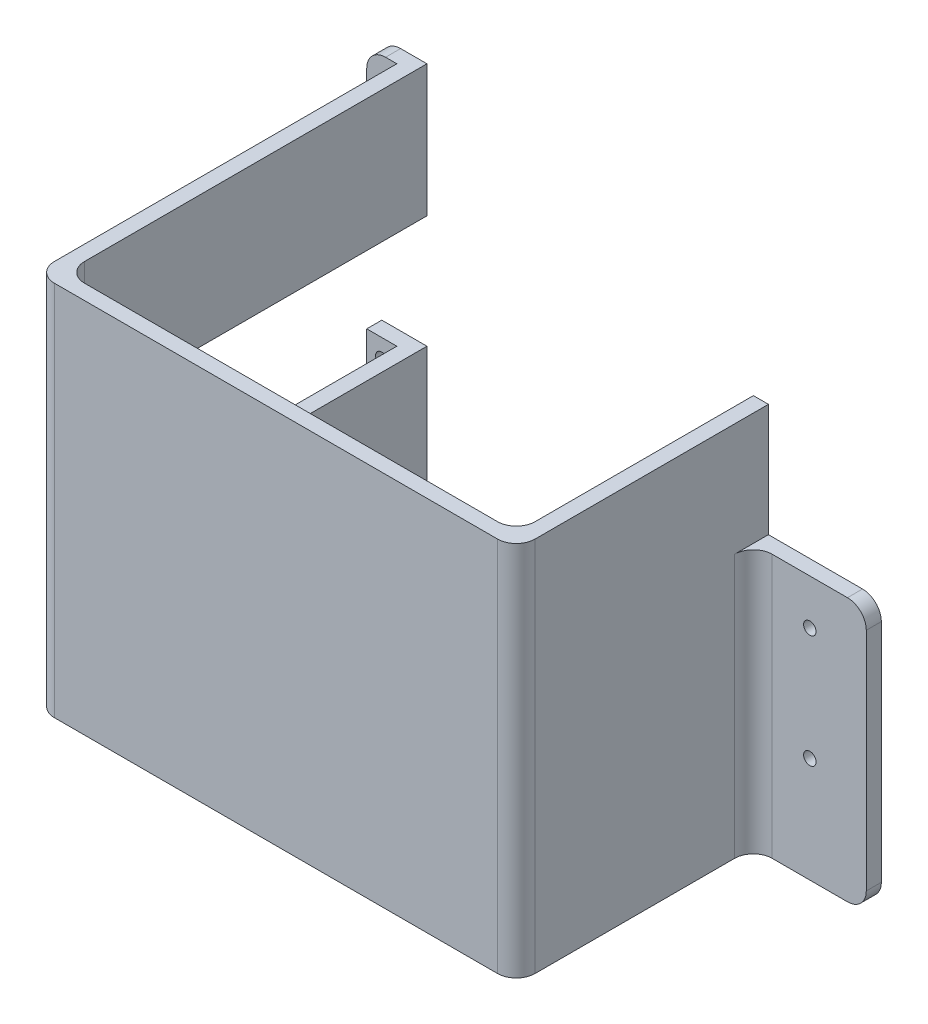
ISO-10303-21;
HEADER;
FILE_DESCRIPTION(('STEP AP214'),'2;1');
FILE_NAME('part.step','',(''),(''),'','','');
FILE_SCHEMA(('AUTOMOTIVE_DESIGN { 1 0 10303 214 1 1 1 1 }'));
ENDSEC;
DATA;
#1=APPLICATION_CONTEXT('core data for automotive mechanical design processes');
#2=APPLICATION_PROTOCOL_DEFINITION('international standard','automotive_design',2000,#1);
#3=PRODUCT_CONTEXT('',#1,'mechanical');
#4=PRODUCT('Part','Part','',(#3));
#5=PRODUCT_RELATED_PRODUCT_CATEGORY('part','',(#4));
#6=PRODUCT_DEFINITION_FORMATION('','',#4);
#7=PRODUCT_DEFINITION_CONTEXT('part definition',#1,'design');
#8=PRODUCT_DEFINITION('design','',#6,#7);
#9=PRODUCT_DEFINITION_SHAPE('','',#8);
#10=(LENGTH_UNIT() NAMED_UNIT(*) SI_UNIT(.MILLI.,.METRE.));
#11=(NAMED_UNIT(*) PLANE_ANGLE_UNIT() SI_UNIT($,.RADIAN.));
#12=(NAMED_UNIT(*) SI_UNIT($,.STERADIAN.) SOLID_ANGLE_UNIT());
#13=UNCERTAINTY_MEASURE_WITH_UNIT(LENGTH_MEASURE(1.E-05),#10,'distance_accuracy_value','');
#14=(GEOMETRIC_REPRESENTATION_CONTEXT(3) GLOBAL_UNCERTAINTY_ASSIGNED_CONTEXT((#13)) GLOBAL_UNIT_ASSIGNED_CONTEXT((#10,
#11,#12)) REPRESENTATION_CONTEXT('',''));
#15=CARTESIAN_POINT('',(0.,0.,0.));
#16=DIRECTION('',(0.,0.,1.));
#17=DIRECTION('',(1.,0.,0.));
#18=AXIS2_PLACEMENT_3D('',#15,#16,#17);
#19=CARTESIAN_POINT('',(13.,0.,95.));
#20=DIRECTION('',(0.,1.,0.));
#21=DIRECTION('',(0.,0.,1.));
#22=AXIS2_PLACEMENT_3D('',#19,#20,#21);
#23=CYLINDRICAL_SURFACE('',#22,5.);
#24=CARTESIAN_POINT('',(13.,0.,95.));
#25=DIRECTION('',(0.,-1.,0.));
#26=DIRECTION('',(0.,0.,-1.));
#27=AXIS2_PLACEMENT_3D('',#24,#25,#26);
#28=CIRCLE('',#27,5.);
#29=CARTESIAN_POINT('',(13.,0.,100.));
#30=VERTEX_POINT('',#29);
#31=CARTESIAN_POINT('',(8.,0.,95.));
#32=VERTEX_POINT('',#31);
#33=EDGE_CURVE('E370',#30,#32,#28,.T.);
#34=ORIENTED_EDGE('',*,*,#33,.F.);
#35=DIRECTION('',(0.,-1.,0.));
#36=VECTOR('',#35,1.);
#37=CARTESIAN_POINT('',(13.,0.,100.));
#38=LINE('',#37,#36);
#39=CARTESIAN_POINT('',(13.,100.,100.));
#40=VERTEX_POINT('',#39);
#41=EDGE_CURVE('E331',#40,#30,#38,.T.);
#42=ORIENTED_EDGE('',*,*,#41,.F.);
#43=CARTESIAN_POINT('',(13.,100.,95.));
#44=DIRECTION('',(0.,1.,0.));
#45=DIRECTION('',(0.,0.,1.));
#46=AXIS2_PLACEMENT_3D('',#43,#44,#45);
#47=CIRCLE('',#46,5.);
#48=CARTESIAN_POINT('',(8.,100.,95.));
#49=VERTEX_POINT('',#48);
#50=EDGE_CURVE('E497',#49,#40,#47,.T.);
#51=ORIENTED_EDGE('',*,*,#50,.F.);
#52=DIRECTION('',(0.,1.,0.));
#53=VECTOR('',#52,1.);
#54=CARTESIAN_POINT('',(8.,0.,95.));
#55=LINE('',#54,#53);
#56=EDGE_CURVE('E315',#32,#49,#55,.T.);
#57=ORIENTED_EDGE('',*,*,#56,.F.);
#58=EDGE_LOOP('',(#34,#42,#51,#57));
#59=FACE_BOUND('',#58,.T.);
#60=ADVANCED_FACE('F17',(#59),#23,.T.);
#61=CARTESIAN_POINT('',(17.,0.,91.));
#62=DIRECTION('',(0.,-1.,0.));
#63=DIRECTION('',(1.,0.,0.));
#64=AXIS2_PLACEMENT_3D('',#61,#62,#63);
#65=CYLINDRICAL_SURFACE('',#64,5.);
#66=CARTESIAN_POINT('',(17.,0.,91.));
#67=DIRECTION('',(0.,1.,0.));
#68=DIRECTION('',(0.,0.,-1.));
#69=AXIS2_PLACEMENT_3D('',#66,#67,#68);
#70=CIRCLE('',#69,5.);
#71=CARTESIAN_POINT('',(12.,0.,91.));
#72=VERTEX_POINT('',#71);
#73=CARTESIAN_POINT('',(17.,0.,96.));
#74=VERTEX_POINT('',#73);
#75=EDGE_CURVE('E384',#72,#74,#70,.T.);
#76=ORIENTED_EDGE('',*,*,#75,.F.);
#77=DIRECTION('',(0.,-1.,0.));
#78=VECTOR('',#77,1.);
#79=CARTESIAN_POINT('',(12.,0.,91.));
#80=LINE('',#79,#78);
#81=CARTESIAN_POINT('',(12.,100.,91.));
#82=VERTEX_POINT('',#81);
#83=EDGE_CURVE('E472',#82,#72,#80,.T.);
#84=ORIENTED_EDGE('',*,*,#83,.F.);
#85=CARTESIAN_POINT('',(17.,100.,91.));
#86=DIRECTION('',(0.,-1.,0.));
#87=DIRECTION('',(0.,0.,1.));
#88=AXIS2_PLACEMENT_3D('',#85,#86,#87);
#89=CIRCLE('',#88,5.);
#90=CARTESIAN_POINT('',(17.,100.,96.));
#91=VERTEX_POINT('',#90);
#92=EDGE_CURVE('E534',#91,#82,#89,.T.);
#93=ORIENTED_EDGE('',*,*,#92,.F.);
#94=DIRECTION('',(0.,1.,0.));
#95=VECTOR('',#94,1.);
#96=CARTESIAN_POINT('',(17.,100.,96.));
#97=LINE('',#96,#95);
#98=EDGE_CURVE('E569',#74,#91,#97,.T.);
#99=ORIENTED_EDGE('',*,*,#98,.F.);
#100=EDGE_LOOP('',(#76,#84,#93,#99));
#101=FACE_BOUND('',#100,.T.);
#102=ADVANCED_FACE('F690',(#101),#65,.F.);
#103=CARTESIAN_POINT('',(12.,65.,71.));
#104=DIRECTION('',(0.,0.,-1.));
#105=DIRECTION('',(0.,-1.,0.));
#106=AXIS2_PLACEMENT_3D('',#103,#104,#105);
#107=PLANE('',#106);
#108=DIRECTION('',(0.,-1.,0.));
#109=VECTOR('',#108,1.);
#110=CARTESIAN_POINT('',(8.,65.,71.));
#111=LINE('',#110,#109);
#112=CARTESIAN_POINT('',(8.,65.,71.));
#113=VERTEX_POINT('',#112);
#114=CARTESIAN_POINT('',(8.,35.,71.));
#115=VERTEX_POINT('',#114);
#116=EDGE_CURVE('E319',#113,#115,#111,.T.);
#117=ORIENTED_EDGE('',*,*,#116,.F.);
#118=DIRECTION('',(-1.,0.,0.));
#119=VECTOR('',#118,1.);
#120=CARTESIAN_POINT('',(12.,65.,71.));
#121=LINE('',#120,#119);
#122=CARTESIAN_POINT('',(12.,65.,71.));
#123=VERTEX_POINT('',#122);
#124=EDGE_CURVE('E628',#123,#113,#121,.T.);
#125=ORIENTED_EDGE('',*,*,#124,.F.);
#126=DIRECTION('',(0.,-1.,0.));
#127=VECTOR('',#126,1.);
#128=CARTESIAN_POINT('',(12.,65.,71.));
#129=LINE('',#128,#127);
#130=CARTESIAN_POINT('',(12.,35.,71.));
#131=VERTEX_POINT('',#130);
#132=EDGE_CURVE('E485',#123,#131,#129,.T.);
#133=ORIENTED_EDGE('',*,*,#132,.T.);
#134=DIRECTION('',(-1.,0.,0.));
#135=VECTOR('',#134,1.);
#136=CARTESIAN_POINT('',(12.,35.,71.));
#137=LINE('',#136,#135);
#138=EDGE_CURVE('E369',#131,#115,#137,.T.);
#139=ORIENTED_EDGE('',*,*,#138,.T.);
#140=EDGE_LOOP('',(#117,#125,#133,#139));
#141=FACE_BOUND('',#140,.T.);
#142=ADVANCED_FACE('F645',(#141),#107,.T.);
#143=CARTESIAN_POINT('',(130.75,0.,95.));
#144=DIRECTION('',(0.,1.,0.));
#145=DIRECTION('',(0.,0.,1.));
#146=AXIS2_PLACEMENT_3D('',#143,#144,#145);
#147=CYLINDRICAL_SURFACE('',#146,5.);
#148=CARTESIAN_POINT('',(130.75,0.,95.));
#149=DIRECTION('',(0.,-1.,0.));
#150=DIRECTION('',(0.,0.,-1.));
#151=AXIS2_PLACEMENT_3D('',#148,#149,#150);
#152=CIRCLE('',#151,5.);
#153=CARTESIAN_POINT('',(135.75,0.,95.));
#154=VERTEX_POINT('',#153);
#155=CARTESIAN_POINT('',(130.75,0.,100.));
#156=VERTEX_POINT('',#155);
#157=EDGE_CURVE('E404',#154,#156,#152,.T.);
#158=ORIENTED_EDGE('',*,*,#157,.F.);
#159=DIRECTION('',(0.,-1.,0.));
#160=VECTOR('',#159,1.);
#161=CARTESIAN_POINT('',(135.75,0.,95.));
#162=LINE('',#161,#160);
#163=CARTESIAN_POINT('',(135.75,100.,95.));
#164=VERTEX_POINT('',#163);
#165=EDGE_CURVE('E374',#164,#154,#162,.T.);
#166=ORIENTED_EDGE('',*,*,#165,.F.);
#167=CARTESIAN_POINT('',(130.75,100.,95.));
#168=DIRECTION('',(0.,1.,0.));
#169=DIRECTION('',(0.,0.,1.));
#170=AXIS2_PLACEMENT_3D('',#167,#168,#169);
#171=CIRCLE('',#170,5.);
#172=CARTESIAN_POINT('',(130.75,100.,100.));
#173=VERTEX_POINT('',#172);
#174=EDGE_CURVE('E505',#173,#164,#171,.T.);
#175=ORIENTED_EDGE('',*,*,#174,.F.);
#176=DIRECTION('',(0.,1.,0.));
#177=VECTOR('',#176,1.);
#178=CARTESIAN_POINT('',(130.75,0.,100.));
#179=LINE('',#178,#177);
#180=EDGE_CURVE('E344',#156,#173,#179,.T.);
#181=ORIENTED_EDGE('',*,*,#180,.F.);
#182=EDGE_LOOP('',(#158,#166,#175,#181));
#183=FACE_BOUND('',#182,.T.);
#184=ADVANCED_FACE('F668',(#183),#147,.T.);
#185=CARTESIAN_POINT('',(126.75,100.,91.));
#186=DIRECTION('',(0.,-1.,0.));
#187=DIRECTION('',(1.,0.,0.));
#188=AXIS2_PLACEMENT_3D('',#185,#186,#187);
#189=CYLINDRICAL_SURFACE('',#188,5.);
#190=CARTESIAN_POINT('',(126.75,0.,91.));
#191=DIRECTION('',(0.,1.,0.));
#192=DIRECTION('',(0.,0.,-1.));
#193=AXIS2_PLACEMENT_3D('',#190,#191,#192);
#194=CIRCLE('',#193,5.);
#195=CARTESIAN_POINT('',(126.75,0.,96.));
#196=VERTEX_POINT('',#195);
#197=CARTESIAN_POINT('',(131.75,0.,91.));
#198=VERTEX_POINT('',#197);
#199=EDGE_CURVE('E392',#196,#198,#194,.T.);
#200=ORIENTED_EDGE('',*,*,#199,.F.);
#201=DIRECTION('',(0.,-1.,0.));
#202=VECTOR('',#201,1.);
#203=CARTESIAN_POINT('',(126.75,0.,96.));
#204=LINE('',#203,#202);
#205=CARTESIAN_POINT('',(126.75,100.,96.));
#206=VERTEX_POINT('',#205);
#207=EDGE_CURVE('E580',#206,#196,#204,.T.);
#208=ORIENTED_EDGE('',*,*,#207,.F.);
#209=CARTESIAN_POINT('',(126.75,100.,91.));
#210=DIRECTION('',(0.,-1.,0.));
#211=DIRECTION('',(0.,0.,1.));
#212=AXIS2_PLACEMENT_3D('',#209,#210,#211);
#213=CIRCLE('',#212,5.);
#214=CARTESIAN_POINT('',(131.75,100.,91.));
#215=VERTEX_POINT('',#214);
#216=EDGE_CURVE('E526',#215,#206,#213,.T.);
#217=ORIENTED_EDGE('',*,*,#216,.F.);
#218=DIRECTION('',(0.,1.,0.));
#219=VECTOR('',#218,1.);
#220=CARTESIAN_POINT('',(131.75,100.,91.));
#221=LINE('',#220,#219);
#222=EDGE_CURVE('E332',#198,#215,#221,.T.);
#223=ORIENTED_EDGE('',*,*,#222,.F.);
#224=EDGE_LOOP('',(#200,#208,#217,#223));
#225=FACE_BOUND('',#224,.T.);
#226=ADVANCED_FACE('F681',(#225),#189,.F.);
#227=CARTESIAN_POINT('',(140.75,100.,42.));
#228=DIRECTION('',(0.,-1.,0.));
#229=DIRECTION('',(0.,0.,-1.));
#230=AXIS2_PLACEMENT_3D('',#227,#228,#229);
#231=CYLINDRICAL_SURFACE('',#230,5.);
#232=CARTESIAN_POINT('',(140.75,70.,42.));
#233=DIRECTION('',(0.,-1.,0.));
#234=DIRECTION('',(0.,0.,-1.));
#235=AXIS2_PLACEMENT_3D('',#232,#233,#234);
#236=CIRCLE('',#235,5.);
#237=CARTESIAN_POINT('',(135.75,70.,42.));
#238=VERTEX_POINT('',#237);
#239=CARTESIAN_POINT('',(140.75,70.,37.));
#240=VERTEX_POINT('',#239);
#241=EDGE_CURVE('E11',#238,#240,#236,.T.);
#242=ORIENTED_EDGE('',*,*,#241,.F.);
#243=DIRECTION('',(0.,1.,0.));
#244=VECTOR('',#243,1.);
#245=CARTESIAN_POINT('',(135.75,0.,42.));
#246=LINE('',#245,#244);
#247=CARTESIAN_POINT('',(135.75,0.,42.));
#248=VERTEX_POINT('',#247);
#249=EDGE_CURVE('E357',#248,#238,#246,.T.);
#250=ORIENTED_EDGE('',*,*,#249,.F.);
#251=CARTESIAN_POINT('',(140.75,0.,42.));
#252=DIRECTION('',(0.,1.,0.));
#253=DIRECTION('',(0.,0.,-1.));
#254=AXIS2_PLACEMENT_3D('',#251,#252,#253);
#255=CIRCLE('',#254,5.);
#256=CARTESIAN_POINT('',(140.75,0.,37.));
#257=VERTEX_POINT('',#256);
#258=EDGE_CURVE('E403',#257,#248,#255,.T.);
#259=ORIENTED_EDGE('',*,*,#258,.F.);
#260=DIRECTION('',(0.,-1.,0.));
#261=VECTOR('',#260,1.);
#262=CARTESIAN_POINT('',(140.75,100.,37.));
#263=LINE('',#262,#261);
#264=EDGE_CURVE('E398',#240,#257,#263,.T.);
#265=ORIENTED_EDGE('',*,*,#264,.F.);
#266=EDGE_LOOP('',(#242,#250,#259,#265));
#267=FACE_BOUND('',#266,.T.);
#268=ADVANCED_FACE('F745',(#267),#231,.F.);
#269=CARTESIAN_POINT('',(160.75,5.,0.));
#270=DIRECTION('',(0.,0.,1.));
#271=DIRECTION('',(1.,0.,0.));
#272=AXIS2_PLACEMENT_3D('',#269,#270,#271);
#273=CYLINDRICAL_SURFACE('',#272,5.);
#274=CARTESIAN_POINT('',(160.75,5.,37.));
#275=DIRECTION('',(0.,0.,1.));
#276=DIRECTION('',(0.,1.,0.));
#277=AXIS2_PLACEMENT_3D('',#274,#275,#276);
#278=CIRCLE('',#277,5.);
#279=CARTESIAN_POINT('',(160.75,0.,37.));
#280=VERTEX_POINT('',#279);
#281=CARTESIAN_POINT('',(165.75,5.,37.));
#282=VERTEX_POINT('',#281);
#283=EDGE_CURVE('E273',#280,#282,#278,.T.);
#284=ORIENTED_EDGE('',*,*,#283,.F.);
#285=DIRECTION('',(0.,0.,1.));
#286=VECTOR('',#285,1.);
#287=CARTESIAN_POINT('',(160.75,0.,37.));
#288=LINE('',#287,#286);
#289=CARTESIAN_POINT('',(160.75,0.,33.));
#290=VERTEX_POINT('',#289);
#291=EDGE_CURVE('E352',#290,#280,#288,.T.);
#292=ORIENTED_EDGE('',*,*,#291,.F.);
#293=CARTESIAN_POINT('',(160.75,5.,33.));
#294=DIRECTION('',(0.,0.,-1.));
#295=DIRECTION('',(-1.,0.,0.));
#296=AXIS2_PLACEMENT_3D('',#293,#294,#295);
#297=CIRCLE('',#296,5.);
#298=CARTESIAN_POINT('',(165.75,5.,33.));
#299=VERTEX_POINT('',#298);
#300=EDGE_CURVE('E287',#299,#290,#297,.T.);
#301=ORIENTED_EDGE('',*,*,#300,.F.);
#302=DIRECTION('',(0.,0.,-1.));
#303=VECTOR('',#302,1.);
#304=CARTESIAN_POINT('',(165.75,5.,33.));
#305=LINE('',#304,#303);
#306=EDGE_CURVE('E272',#282,#299,#305,.T.);
#307=ORIENTED_EDGE('',*,*,#306,.F.);
#308=EDGE_LOOP('',(#284,#292,#301,#307));
#309=FACE_BOUND('',#308,.T.);
#310=ADVANCED_FACE('F756',(#309),#273,.T.);
#311=CARTESIAN_POINT('',(160.75,65.,0.));
#312=DIRECTION('',(0.,0.,1.));
#313=DIRECTION('',(1.,0.,0.));
#314=AXIS2_PLACEMENT_3D('',#311,#312,#313);
#315=CYLINDRICAL_SURFACE('',#314,5.);
#316=CARTESIAN_POINT('',(160.75,65.,33.));
#317=DIRECTION('',(0.,0.,-1.));
#318=DIRECTION('',(-1.,0.,0.));
#319=AXIS2_PLACEMENT_3D('',#316,#317,#318);
#320=CIRCLE('',#319,5.);
#321=CARTESIAN_POINT('',(160.75,70.,33.));
#322=VERTEX_POINT('',#321);
#323=CARTESIAN_POINT('',(165.75,65.,33.));
#324=VERTEX_POINT('',#323);
#325=EDGE_CURVE('E428',#322,#324,#320,.T.);
#326=ORIENTED_EDGE('',*,*,#325,.F.);
#327=DIRECTION('',(0.,0.,-1.));
#328=VECTOR('',#327,1.);
#329=CARTESIAN_POINT('',(160.75,70.,0.));
#330=LINE('',#329,#328);
#331=CARTESIAN_POINT('',(160.75,70.,37.));
#332=VERTEX_POINT('',#331);
#333=EDGE_CURVE('E20',#332,#322,#330,.T.);
#334=ORIENTED_EDGE('',*,*,#333,.F.);
#335=CARTESIAN_POINT('',(160.75,65.,37.));
#336=DIRECTION('',(0.,0.,1.));
#337=DIRECTION('',(0.,1.,0.));
#338=AXIS2_PLACEMENT_3D('',#335,#336,#337);
#339=CIRCLE('',#338,5.);
#340=CARTESIAN_POINT('',(165.75,65.,37.));
#341=VERTEX_POINT('',#340);
#342=EDGE_CURVE('E276',#341,#332,#339,.T.);
#343=ORIENTED_EDGE('',*,*,#342,.F.);
#344=DIRECTION('',(0.,0.,1.));
#345=VECTOR('',#344,1.);
#346=CARTESIAN_POINT('',(165.75,65.,0.));
#347=LINE('',#346,#345);
#348=EDGE_CURVE('E264',#324,#341,#347,.T.);
#349=ORIENTED_EDGE('',*,*,#348,.F.);
#350=EDGE_LOOP('',(#326,#334,#343,#349));
#351=FACE_BOUND('',#350,.T.);
#352=ADVANCED_FACE('F277',(#351),#315,.T.);
#353=CARTESIAN_POINT('',(5.,95.,4.));
#354=DIRECTION('',(0.,0.,-1.));
#355=DIRECTION('',(-1.,0.,0.));
#356=AXIS2_PLACEMENT_3D('',#353,#354,#355);
#357=CYLINDRICAL_SURFACE('',#356,5.);
#358=CARTESIAN_POINT('',(5.,95.,4.));
#359=DIRECTION('',(0.,0.,1.));
#360=DIRECTION('',(1.,0.,0.));
#361=AXIS2_PLACEMENT_3D('',#358,#359,#360);
#362=CIRCLE('',#361,5.);
#363=CARTESIAN_POINT('',(5.,100.,4.));
#364=VERTEX_POINT('',#363);
#365=CARTESIAN_POINT('',(0.,95.,4.));
#366=VERTEX_POINT('',#365);
#367=EDGE_CURVE('E307',#364,#366,#362,.T.);
#368=ORIENTED_EDGE('',*,*,#367,.F.);
#369=DIRECTION('',(0.,0.,1.));
#370=VECTOR('',#369,1.);
#371=CARTESIAN_POINT('',(5.,100.,4.));
#372=LINE('',#371,#370);
#373=CARTESIAN_POINT('',(5.,100.,0.));
#374=VERTEX_POINT('',#373);
#375=EDGE_CURVE('E537',#374,#364,#372,.T.);
#376=ORIENTED_EDGE('',*,*,#375,.F.);
#377=CARTESIAN_POINT('',(5.,95.,0.));
#378=DIRECTION('',(0.,0.,-1.));
#379=DIRECTION('',(1.,0.,0.));
#380=AXIS2_PLACEMENT_3D('',#377,#378,#379);
#381=CIRCLE('',#380,5.);
#382=CARTESIAN_POINT('',(0.,95.,0.));
#383=VERTEX_POINT('',#382);
#384=EDGE_CURVE('E316',#383,#374,#381,.T.);
#385=ORIENTED_EDGE('',*,*,#384,.F.);
#386=DIRECTION('',(0.,0.,-1.));
#387=VECTOR('',#386,1.);
#388=CARTESIAN_POINT('',(0.,95.,4.));
#389=LINE('',#388,#387);
#390=EDGE_CURVE('E302',#366,#383,#389,.T.);
#391=ORIENTED_EDGE('',*,*,#390,.F.);
#392=EDGE_LOOP('',(#368,#376,#385,#391));
#393=FACE_BOUND('',#392,.T.);
#394=ADVANCED_FACE('F700',(#393),#357,.T.);
#395=CARTESIAN_POINT('',(5.,5.,96.));
#396=DIRECTION('',(0.,0.,-1.));
#397=DIRECTION('',(-1.,0.,0.));
#398=AXIS2_PLACEMENT_3D('',#395,#396,#397);
#399=CYLINDRICAL_SURFACE('',#398,5.);
#400=CARTESIAN_POINT('',(5.,5.,4.));
#401=DIRECTION('',(0.,0.,1.));
#402=DIRECTION('',(1.,0.,0.));
#403=AXIS2_PLACEMENT_3D('',#400,#401,#402);
#404=CIRCLE('',#403,5.);
#405=CARTESIAN_POINT('',(0.,5.,4.));
#406=VERTEX_POINT('',#405);
#407=CARTESIAN_POINT('',(5.,0.,4.));
#408=VERTEX_POINT('',#407);
#409=EDGE_CURVE('E407',#406,#408,#404,.T.);
#410=ORIENTED_EDGE('',*,*,#409,.F.);
#411=DIRECTION('',(0.,0.,1.));
#412=VECTOR('',#411,1.);
#413=CARTESIAN_POINT('',(0.,5.,4.));
#414=LINE('',#413,#412);
#415=CARTESIAN_POINT('',(0.,5.,0.));
#416=VERTEX_POINT('',#415);
#417=EDGE_CURVE('E388',#416,#406,#414,.T.);
#418=ORIENTED_EDGE('',*,*,#417,.F.);
#419=CARTESIAN_POINT('',(5.,5.,0.));
#420=DIRECTION('',(0.,0.,-1.));
#421=DIRECTION('',(1.,0.,0.));
#422=AXIS2_PLACEMENT_3D('',#419,#420,#421);
#423=CIRCLE('',#422,5.);
#424=CARTESIAN_POINT('',(5.,0.,0.));
#425=VERTEX_POINT('',#424);
#426=EDGE_CURVE('E336',#425,#416,#423,.T.);
#427=ORIENTED_EDGE('',*,*,#426,.F.);
#428=DIRECTION('',(0.,0.,-1.));
#429=VECTOR('',#428,1.);
#430=CARTESIAN_POINT('',(5.,0.,96.));
#431=LINE('',#430,#429);
#432=EDGE_CURVE('E377',#408,#425,#431,.T.);
#433=ORIENTED_EDGE('',*,*,#432,.F.);
#434=EDGE_LOOP('',(#410,#418,#427,#433));
#435=FACE_BOUND('',#434,.T.);
#436=ADVANCED_FACE('F715',(#435),#399,.T.);
#437=CARTESIAN_POINT('',(165.75,70.,0.));
#438=DIRECTION('',(0.,-1.,0.));
#439=DIRECTION('',(0.,0.,-1.));
#440=AXIS2_PLACEMENT_3D('',#437,#438,#439);
#441=PLANE('',#440);
#442=DIRECTION('',(1.,0.,0.));
#443=VECTOR('',#442,1.);
#444=CARTESIAN_POINT('',(165.75,70.,37.));
#445=LINE('',#444,#443);
#446=EDGE_CURVE('E281',#240,#332,#445,.T.);
#447=ORIENTED_EDGE('',*,*,#446,.T.);
#448=ORIENTED_EDGE('',*,*,#333,.T.);
#449=DIRECTION('',(-1.,0.,0.));
#450=VECTOR('',#449,1.);
#451=CARTESIAN_POINT('',(0.,70.,33.));
#452=LINE('',#451,#450);
#453=CARTESIAN_POINT('',(135.75,70.,33.));
#454=VERTEX_POINT('',#453);
#455=EDGE_CURVE('E427',#322,#454,#452,.T.);
#456=ORIENTED_EDGE('',*,*,#455,.T.);
#457=DIRECTION('',(0.,0.,1.));
#458=VECTOR('',#457,1.);
#459=CARTESIAN_POINT('',(135.75,70.,0.));
#460=LINE('',#459,#458);
#461=EDGE_CURVE('E361',#454,#238,#460,.T.);
#462=ORIENTED_EDGE('',*,*,#461,.T.);
#463=ORIENTED_EDGE('',*,*,#241,.T.);
#464=EDGE_LOOP('',(#447,#448,#456,#462,#463));
#465=FACE_BOUND('',#464,.T.);
#466=ADVANCED_FACE('F441',(#465),#441,.F.);
#467=CARTESIAN_POINT('',(165.75,0.,0.));
#468=DIRECTION('',(-1.,0.,0.));
#469=DIRECTION('',(0.,0.,1.));
#470=AXIS2_PLACEMENT_3D('',#467,#468,#469);
#471=PLANE('',#470);
#472=DIRECTION('',(0.,1.,0.));
#473=VECTOR('',#472,1.);
#474=CARTESIAN_POINT('',(165.75,100.,33.));
#475=LINE('',#474,#473);
#476=EDGE_CURVE('E269',#299,#324,#475,.T.);
#477=ORIENTED_EDGE('',*,*,#476,.T.);
#478=ORIENTED_EDGE('',*,*,#348,.T.);
#479=DIRECTION('',(0.,-1.,0.));
#480=VECTOR('',#479,1.);
#481=CARTESIAN_POINT('',(165.75,100.,37.));
#482=LINE('',#481,#480);
#483=EDGE_CURVE('E267',#341,#282,#482,.T.);
#484=ORIENTED_EDGE('',*,*,#483,.T.);
#485=ORIENTED_EDGE('',*,*,#306,.T.);
#486=EDGE_LOOP('',(#477,#478,#484,#485));
#487=FACE_BOUND('',#486,.T.);
#488=ADVANCED_FACE('F265',(#487),#471,.F.);
#489=CARTESIAN_POINT('',(165.75,100.,37.));
#490=DIRECTION('',(0.,0.,-1.));
#491=DIRECTION('',(-1.,0.,0.));
#492=AXIS2_PLACEMENT_3D('',#489,#490,#491);
#493=PLANE('',#492);
#494=CARTESIAN_POINT('',(150.749999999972,27.9999999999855,37.));
#495=DIRECTION('',(0.,0.,1.));
#496=DIRECTION('',(1.,0.,0.));
#497=AXIS2_PLACEMENT_3D('',#494,#495,#496);
#498=CIRCLE('',#497,1.65000000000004);
#499=CARTESIAN_POINT('',(152.399999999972,27.9999999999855,37.));
#500=VERTEX_POINT('',#499);
#501=EDGE_CURVE('E589',#500,#500,#498,.T.);
#502=ORIENTED_EDGE('',*,*,#501,.F.);
#503=EDGE_LOOP('',(#502));
#504=FACE_BOUND('',#503,.T.);
#505=CARTESIAN_POINT('',(150.749999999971,57.9999999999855,37.));
#506=DIRECTION('',(0.,0.,1.));
#507=DIRECTION('',(1.,0.,0.));
#508=AXIS2_PLACEMENT_3D('',#505,#506,#507);
#509=CIRCLE('',#508,1.65000000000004);
#510=CARTESIAN_POINT('',(152.399999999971,57.9999999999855,37.));
#511=VERTEX_POINT('',#510);
#512=EDGE_CURVE('E575',#511,#511,#509,.T.);
#513=ORIENTED_EDGE('',*,*,#512,.F.);
#514=EDGE_LOOP('',(#513));
#515=FACE_BOUND('',#514,.T.);
#516=ORIENTED_EDGE('',*,*,#483,.F.);
#517=ORIENTED_EDGE('',*,*,#342,.T.);
#518=ORIENTED_EDGE('',*,*,#446,.F.);
#519=ORIENTED_EDGE('',*,*,#264,.T.);
#520=DIRECTION('',(-1.,0.,0.));
#521=VECTOR('',#520,1.);
#522=CARTESIAN_POINT('',(165.75,0.,37.));
#523=LINE('',#522,#521);
#524=EDGE_CURVE('E399',#280,#257,#523,.T.);
#525=ORIENTED_EDGE('',*,*,#524,.F.);
#526=ORIENTED_EDGE('',*,*,#283,.T.);
#527=EDGE_LOOP('',(#516,#517,#518,#519,#525,#526));
#528=FACE_BOUND('',#527,.T.);
#529=ADVANCED_FACE('F284',(#504,#515,#528),#493,.F.);
#530=CARTESIAN_POINT('',(0.,0.,33.));
#531=DIRECTION('',(0.,0.,-1.));
#532=DIRECTION('',(0.,-1.,0.));
#533=AXIS2_PLACEMENT_3D('',#530,#531,#532);
#534=PLANE('',#533);
#535=CARTESIAN_POINT('',(150.749999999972,27.9999999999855,33.));
#536=DIRECTION('',(0.,0.,-1.));
#537=DIRECTION('',(-1.,0.,0.));
#538=AXIS2_PLACEMENT_3D('',#535,#536,#537);
#539=CIRCLE('',#538,1.65000000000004);
#540=CARTESIAN_POINT('',(149.099999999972,27.9999999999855,33.));
#541=VERTEX_POINT('',#540);
#542=EDGE_CURVE('E579',#541,#541,#539,.T.);
#543=ORIENTED_EDGE('',*,*,#542,.F.);
#544=EDGE_LOOP('',(#543));
#545=FACE_BOUND('',#544,.T.);
#546=CARTESIAN_POINT('',(150.749999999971,57.9999999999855,33.));
#547=DIRECTION('',(0.,0.,-1.));
#548=DIRECTION('',(-1.,0.,0.));
#549=AXIS2_PLACEMENT_3D('',#546,#547,#548);
#550=CIRCLE('',#549,1.65000000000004);
#551=CARTESIAN_POINT('',(149.099999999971,57.9999999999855,33.));
#552=VERTEX_POINT('',#551);
#553=EDGE_CURVE('E571',#552,#552,#550,.T.);
#554=ORIENTED_EDGE('',*,*,#553,.F.);
#555=EDGE_LOOP('',(#554));
#556=FACE_BOUND('',#555,.T.);
#557=ORIENTED_EDGE('',*,*,#455,.F.);
#558=ORIENTED_EDGE('',*,*,#325,.T.);
#559=ORIENTED_EDGE('',*,*,#476,.F.);
#560=ORIENTED_EDGE('',*,*,#300,.T.);
#561=DIRECTION('',(-1.,0.,0.));
#562=VECTOR('',#561,1.);
#563=CARTESIAN_POINT('',(135.75,0.,33.));
#564=LINE('',#563,#562);
#565=CARTESIAN_POINT('',(131.75,0.,33.));
#566=VERTEX_POINT('',#565);
#567=EDGE_CURVE('E348',#290,#566,#564,.T.);
#568=ORIENTED_EDGE('',*,*,#567,.T.);
#569=DIRECTION('',(0.,1.,0.));
#570=VECTOR('',#569,1.);
#571=CARTESIAN_POINT('',(131.75,100.,33.));
#572=LINE('',#571,#570);
#573=CARTESIAN_POINT('',(131.75,100.,33.));
#574=VERTEX_POINT('',#573);
#575=EDGE_CURVE('E335',#566,#574,#572,.T.);
#576=ORIENTED_EDGE('',*,*,#575,.T.);
#577=DIRECTION('',(1.,0.,0.));
#578=VECTOR('',#577,1.);
#579=CARTESIAN_POINT('',(135.75,100.,33.));
#580=LINE('',#579,#578);
#581=CARTESIAN_POINT('',(135.75,100.,33.));
#582=VERTEX_POINT('',#581);
#583=EDGE_CURVE('E515',#574,#582,#580,.T.);
#584=ORIENTED_EDGE('',*,*,#583,.T.);
#585=DIRECTION('',(0.,1.,0.));
#586=VECTOR('',#585,1.);
#587=CARTESIAN_POINT('',(135.75,0.,33.));
#588=LINE('',#587,#586);
#589=EDGE_CURVE('E364',#454,#582,#588,.T.);
#590=ORIENTED_EDGE('',*,*,#589,.F.);
#591=EDGE_LOOP('',(#557,#558,#559,#560,#568,#576,#584,#590));
#592=FACE_BOUND('',#591,.T.);
#593=ADVANCED_FACE('F445',(#545,#556,#592),#534,.T.);
#594=CARTESIAN_POINT('',(131.75,100.,-67.0799680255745));
#595=DIRECTION('',(1.,0.,0.));
#596=DIRECTION('',(0.,-1.,0.));
#597=AXIS2_PLACEMENT_3D('',#594,#595,#596);
#598=PLANE('',#597);
#599=DIRECTION('',(0.,0.,1.));
#600=VECTOR('',#599,1.);
#601=CARTESIAN_POINT('',(131.75,0.,-67.0799680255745));
#602=LINE('',#601,#600);
#603=EDGE_CURVE('E353',#566,#198,#602,.T.);
#604=ORIENTED_EDGE('',*,*,#603,.T.);
#605=ORIENTED_EDGE('',*,*,#222,.T.);
#606=DIRECTION('',(0.,0.,1.));
#607=VECTOR('',#606,1.);
#608=CARTESIAN_POINT('',(131.75,100.,-67.0799680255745));
#609=LINE('',#608,#607);
#610=EDGE_CURVE('E522',#574,#215,#609,.T.);
#611=ORIENTED_EDGE('',*,*,#610,.F.);
#612=ORIENTED_EDGE('',*,*,#575,.F.);
#613=EDGE_LOOP('',(#604,#605,#611,#612));
#614=FACE_BOUND('',#613,.T.);
#615=ADVANCED_FACE('F677',(#614),#598,.F.);
#616=CARTESIAN_POINT('',(0.,0.,0.));
#617=DIRECTION('',(0.,0.,1.));
#618=DIRECTION('',(1.,0.,0.));
#619=AXIS2_PLACEMENT_3D('',#616,#617,#618);
#620=PLANE('',#619);
#621=CARTESIAN_POINT('',(4.,30.,0.));
#622=DIRECTION('',(0.,0.,1.));
#623=DIRECTION('',(1.,0.,0.));
#624=AXIS2_PLACEMENT_3D('',#621,#622,#623);
#625=CIRCLE('',#624,1.65);
#626=CARTESIAN_POINT('',(5.65,30.,0.));
#627=VERTEX_POINT('',#626);
#628=EDGE_CURVE('E609',#627,#627,#625,.T.);
#629=ORIENTED_EDGE('',*,*,#628,.T.);
#630=EDGE_LOOP('',(#629));
#631=FACE_BOUND('',#630,.T.);
#632=DIRECTION('',(1.,0.,0.));
#633=VECTOR('',#632,1.);
#634=CARTESIAN_POINT('',(0.,0.,0.));
#635=LINE('',#634,#633);
#636=CARTESIAN_POINT('',(12.,0.,0.));
#637=VERTEX_POINT('',#636);
#638=EDGE_CURVE('E381',#425,#637,#635,.T.);
#639=ORIENTED_EDGE('',*,*,#638,.F.);
#640=ORIENTED_EDGE('',*,*,#426,.T.);
#641=DIRECTION('',(0.,1.,0.));
#642=VECTOR('',#641,1.);
#643=CARTESIAN_POINT('',(0.,0.,0.));
#644=LINE('',#643,#642);
#645=CARTESIAN_POINT('',(0.,35.,0.));
#646=VERTEX_POINT('',#645);
#647=EDGE_CURVE('E385',#416,#646,#644,.T.);
#648=ORIENTED_EDGE('',*,*,#647,.T.);
#649=DIRECTION('',(1.,0.,0.));
#650=VECTOR('',#649,1.);
#651=CARTESIAN_POINT('',(0.,35.,0.));
#652=LINE('',#651,#650);
#653=CARTESIAN_POINT('',(12.,35.,0.));
#654=VERTEX_POINT('',#653);
#655=EDGE_CURVE('E365',#646,#654,#652,.T.);
#656=ORIENTED_EDGE('',*,*,#655,.T.);
#657=DIRECTION('',(0.,-1.,0.));
#658=VECTOR('',#657,1.);
#659=CARTESIAN_POINT('',(12.,35.,0.));
#660=LINE('',#659,#658);
#661=EDGE_CURVE('E480',#654,#637,#660,.T.);
#662=ORIENTED_EDGE('',*,*,#661,.T.);
#663=EDGE_LOOP('',(#639,#640,#648,#656,#662));
#664=FACE_BOUND('',#663,.T.);
#665=ADVANCED_FACE('F708',(#631,#664),#620,.F.);
#666=CARTESIAN_POINT('',(0.,0.,4.));
#667=DIRECTION('',(0.,0.,1.));
#668=DIRECTION('',(1.,0.,0.));
#669=AXIS2_PLACEMENT_3D('',#666,#667,#668);
#670=PLANE('',#669);
#671=CARTESIAN_POINT('',(4.,30.,4.));
#672=DIRECTION('',(0.,0.,1.));
#673=DIRECTION('',(1.,0.,0.));
#674=AXIS2_PLACEMENT_3D('',#671,#672,#673);
#675=CIRCLE('',#674,1.65);
#676=CARTESIAN_POINT('',(5.65,30.,4.));
#677=VERTEX_POINT('',#676);
#678=EDGE_CURVE('E597',#677,#677,#675,.T.);
#679=ORIENTED_EDGE('',*,*,#678,.F.);
#680=EDGE_LOOP('',(#679));
#681=FACE_BOUND('',#680,.T.);
#682=DIRECTION('',(0.,1.,0.));
#683=VECTOR('',#682,1.);
#684=CARTESIAN_POINT('',(0.,0.,4.));
#685=LINE('',#684,#683);
#686=CARTESIAN_POINT('',(0.,35.,4.));
#687=VERTEX_POINT('',#686);
#688=EDGE_CURVE('E410',#406,#687,#685,.T.);
#689=ORIENTED_EDGE('',*,*,#688,.F.);
#690=ORIENTED_EDGE('',*,*,#409,.T.);
#691=DIRECTION('',(1.,0.,0.));
#692=VECTOR('',#691,1.);
#693=CARTESIAN_POINT('',(0.,0.,4.));
#694=LINE('',#693,#692);
#695=CARTESIAN_POINT('',(8.,0.,4.));
#696=VERTEX_POINT('',#695);
#697=EDGE_CURVE('E373',#408,#696,#694,.T.);
#698=ORIENTED_EDGE('',*,*,#697,.T.);
#699=DIRECTION('',(0.,-1.,0.));
#700=VECTOR('',#699,1.);
#701=CARTESIAN_POINT('',(8.,0.,4.));
#702=LINE('',#701,#700);
#703=CARTESIAN_POINT('',(8.,35.,4.));
#704=VERTEX_POINT('',#703);
#705=EDGE_CURVE('E327',#704,#696,#702,.T.);
#706=ORIENTED_EDGE('',*,*,#705,.F.);
#707=DIRECTION('',(1.,0.,0.));
#708=VECTOR('',#707,1.);
#709=CARTESIAN_POINT('',(0.,35.,4.));
#710=LINE('',#709,#708);
#711=EDGE_CURVE('E389',#687,#704,#710,.T.);
#712=ORIENTED_EDGE('',*,*,#711,.F.);
#713=EDGE_LOOP('',(#689,#690,#698,#706,#712));
#714=FACE_BOUND('',#713,.T.);
#715=ADVANCED_FACE('F655',(#681,#714),#670,.T.);
#716=CARTESIAN_POINT('',(0.,0.,4.));
#717=DIRECTION('',(-1.,0.,0.));
#718=DIRECTION('',(0.,0.,1.));
#719=AXIS2_PLACEMENT_3D('',#716,#717,#718);
#720=PLANE('',#719);
#721=ORIENTED_EDGE('',*,*,#647,.F.);
#722=ORIENTED_EDGE('',*,*,#417,.T.);
#723=ORIENTED_EDGE('',*,*,#688,.T.);
#724=DIRECTION('',(0.,0.,-1.));
#725=VECTOR('',#724,1.);
#726=CARTESIAN_POINT('',(0.,35.,4.));
#727=LINE('',#726,#725);
#728=EDGE_CURVE('E368',#687,#646,#727,.T.);
#729=ORIENTED_EDGE('',*,*,#728,.T.);
#730=EDGE_LOOP('',(#721,#722,#723,#729));
#731=FACE_BOUND('',#730,.T.);
#732=ADVANCED_FACE('F712',(#731),#720,.T.);
#733=CARTESIAN_POINT('',(0.,35.,4.));
#734=DIRECTION('',(0.,1.,0.));
#735=DIRECTION('',(1.,0.,0.));
#736=AXIS2_PLACEMENT_3D('',#733,#734,#735);
#737=PLANE('',#736);
#738=ORIENTED_EDGE('',*,*,#138,.F.);
#739=DIRECTION('',(0.,0.,-1.));
#740=VECTOR('',#739,1.);
#741=CARTESIAN_POINT('',(12.,35.,100.));
#742=LINE('',#741,#740);
#743=EDGE_CURVE('E481',#131,#654,#742,.T.);
#744=ORIENTED_EDGE('',*,*,#743,.T.);
#745=ORIENTED_EDGE('',*,*,#655,.F.);
#746=ORIENTED_EDGE('',*,*,#728,.F.);
#747=ORIENTED_EDGE('',*,*,#711,.T.);
#748=DIRECTION('',(0.,0.,-1.));
#749=VECTOR('',#748,1.);
#750=CARTESIAN_POINT('',(8.,35.,100.));
#751=LINE('',#750,#749);
#752=EDGE_CURVE('E323',#115,#704,#751,.T.);
#753=ORIENTED_EDGE('',*,*,#752,.F.);
#754=EDGE_LOOP('',(#738,#744,#745,#746,#747,#753));
#755=FACE_BOUND('',#754,.T.);
#756=ADVANCED_FACE('F648',(#755),#737,.T.);
#757=CARTESIAN_POINT('',(0.,0.,96.));
#758=DIRECTION('',(0.,-1.,0.));
#759=DIRECTION('',(0.,0.,-1.));
#760=AXIS2_PLACEMENT_3D('',#757,#758,#759);
#761=PLANE('',#760);
#762=DIRECTION('',(1.,0.,0.));
#763=VECTOR('',#762,1.);
#764=CARTESIAN_POINT('',(0.,0.,100.));
#765=LINE('',#764,#763);
#766=EDGE_CURVE('E340',#30,#156,#765,.T.);
#767=ORIENTED_EDGE('',*,*,#766,.F.);
#768=ORIENTED_EDGE('',*,*,#33,.T.);
#769=DIRECTION('',(0.,0.,-1.));
#770=VECTOR('',#769,1.);
#771=CARTESIAN_POINT('',(8.,0.,100.));
#772=LINE('',#771,#770);
#773=EDGE_CURVE('E311',#32,#696,#772,.T.);
#774=ORIENTED_EDGE('',*,*,#773,.T.);
#775=ORIENTED_EDGE('',*,*,#697,.F.);
#776=ORIENTED_EDGE('',*,*,#432,.T.);
#777=ORIENTED_EDGE('',*,*,#638,.T.);
#778=DIRECTION('',(0.,0.,-1.));
#779=VECTOR('',#778,1.);
#780=CARTESIAN_POINT('',(12.,0.,100.));
#781=LINE('',#780,#779);
#782=EDGE_CURVE('E476',#72,#637,#781,.T.);
#783=ORIENTED_EDGE('',*,*,#782,.F.);
#784=ORIENTED_EDGE('',*,*,#75,.T.);
#785=DIRECTION('',(1.,0.,0.));
#786=VECTOR('',#785,1.);
#787=CARTESIAN_POINT('',(0.,0.,96.));
#788=LINE('',#787,#786);
#789=EDGE_CURVE('E565',#74,#196,#788,.T.);
#790=ORIENTED_EDGE('',*,*,#789,.T.);
#791=ORIENTED_EDGE('',*,*,#199,.T.);
#792=ORIENTED_EDGE('',*,*,#603,.F.);
#793=ORIENTED_EDGE('',*,*,#567,.F.);
#794=ORIENTED_EDGE('',*,*,#291,.T.);
#795=ORIENTED_EDGE('',*,*,#524,.T.);
#796=ORIENTED_EDGE('',*,*,#258,.T.);
#797=DIRECTION('',(0.,0.,1.));
#798=VECTOR('',#797,1.);
#799=CARTESIAN_POINT('',(135.75,0.,96.));
#800=LINE('',#799,#798);
#801=EDGE_CURVE('E347',#248,#154,#800,.T.);
#802=ORIENTED_EDGE('',*,*,#801,.T.);
#803=ORIENTED_EDGE('',*,*,#157,.T.);
#804=EDGE_LOOP('',(#767,#768,#774,#775,#776,#777,#783,#784,#790,#791,#792,#793,#794,#795,#796,
#802,#803));
#805=FACE_BOUND('',#804,.T.);
#806=ADVANCED_FACE('F659',(#805),#761,.T.);
#807=CARTESIAN_POINT('',(135.75,0.,96.));
#808=DIRECTION('',(1.,0.,0.));
#809=DIRECTION('',(0.,1.,0.));
#810=AXIS2_PLACEMENT_3D('',#807,#808,#809);
#811=PLANE('',#810);
#812=ORIENTED_EDGE('',*,*,#801,.F.);
#813=ORIENTED_EDGE('',*,*,#249,.T.);
#814=ORIENTED_EDGE('',*,*,#461,.F.);
#815=ORIENTED_EDGE('',*,*,#589,.T.);
#816=DIRECTION('',(0.,0.,1.));
#817=VECTOR('',#816,1.);
#818=CARTESIAN_POINT('',(135.75,100.,96.));
#819=LINE('',#818,#817);
#820=EDGE_CURVE('E512',#582,#164,#819,.T.);
#821=ORIENTED_EDGE('',*,*,#820,.T.);
#822=ORIENTED_EDGE('',*,*,#165,.T.);
#823=EDGE_LOOP('',(#812,#813,#814,#815,#821,#822));
#824=FACE_BOUND('',#823,.T.);
#825=ADVANCED_FACE('F671',(#824),#811,.T.);
#826=CARTESIAN_POINT('',(0.,0.,100.));
#827=DIRECTION('',(0.,0.,1.));
#828=DIRECTION('',(1.,0.,0.));
#829=AXIS2_PLACEMENT_3D('',#826,#827,#828);
#830=PLANE('',#829);
#831=DIRECTION('',(1.,0.,0.));
#832=VECTOR('',#831,1.);
#833=CARTESIAN_POINT('',(0.,100.,100.));
#834=LINE('',#833,#832);
#835=EDGE_CURVE('E501',#40,#173,#834,.T.);
#836=ORIENTED_EDGE('',*,*,#835,.F.);
#837=ORIENTED_EDGE('',*,*,#41,.T.);
#838=ORIENTED_EDGE('',*,*,#766,.T.);
#839=ORIENTED_EDGE('',*,*,#180,.T.);
#840=EDGE_LOOP('',(#836,#837,#838,#839));
#841=FACE_BOUND('',#840,.T.);
#842=ADVANCED_FACE('F665',(#841),#830,.T.);
#843=CARTESIAN_POINT('',(8.,0.,100.));
#844=DIRECTION('',(-1.,0.,0.));
#845=DIRECTION('',(0.,0.,1.));
#846=AXIS2_PLACEMENT_3D('',#843,#844,#845);
#847=PLANE('',#846);
#848=ORIENTED_EDGE('',*,*,#773,.F.);
#849=ORIENTED_EDGE('',*,*,#56,.T.);
#850=DIRECTION('',(0.,0.,-1.));
#851=VECTOR('',#850,1.);
#852=CARTESIAN_POINT('',(8.,100.,100.));
#853=LINE('',#852,#851);
#854=CARTESIAN_POINT('',(8.,100.,4.));
#855=VERTEX_POINT('',#854);
#856=EDGE_CURVE('E496',#49,#855,#853,.T.);
#857=ORIENTED_EDGE('',*,*,#856,.T.);
#858=DIRECTION('',(0.,1.,0.));
#859=VECTOR('',#858,1.);
#860=CARTESIAN_POINT('',(8.,0.,4.));
#861=LINE('',#860,#859);
#862=CARTESIAN_POINT('',(8.,65.,4.));
#863=VERTEX_POINT('',#862);
#864=EDGE_CURVE('E310',#863,#855,#861,.T.);
#865=ORIENTED_EDGE('',*,*,#864,.F.);
#866=DIRECTION('',(0.,0.,-1.));
#867=VECTOR('',#866,1.);
#868=CARTESIAN_POINT('',(8.,65.,100.));
#869=LINE('',#868,#867);
#870=EDGE_CURVE('E454',#113,#863,#869,.T.);
#871=ORIENTED_EDGE('',*,*,#870,.F.);
#872=ORIENTED_EDGE('',*,*,#116,.T.);
#873=ORIENTED_EDGE('',*,*,#752,.T.);
#874=ORIENTED_EDGE('',*,*,#705,.T.);
#875=EDGE_LOOP('',(#848,#849,#857,#865,#871,#872,#873,#874));
#876=FACE_BOUND('',#875,.T.);
#877=ADVANCED_FACE('F556',(#876),#847,.T.);
#878=CARTESIAN_POINT('',(0.,0.,0.));
#879=DIRECTION('',(0.,0.,1.));
#880=DIRECTION('',(1.,0.,0.));
#881=AXIS2_PLACEMENT_3D('',#878,#879,#880);
#882=PLANE('',#881);
#883=CARTESIAN_POINT('',(4.,70.,0.));
#884=DIRECTION('',(0.,0.,1.));
#885=DIRECTION('',(1.,0.,0.));
#886=AXIS2_PLACEMENT_3D('',#883,#884,#885);
#887=CIRCLE('',#886,1.65);
#888=CARTESIAN_POINT('',(5.65,70.,0.));
#889=VERTEX_POINT('',#888);
#890=EDGE_CURVE('E570',#889,#889,#887,.T.);
#891=ORIENTED_EDGE('',*,*,#890,.T.);
#892=EDGE_LOOP('',(#891));
#893=FACE_BOUND('',#892,.T.);
#894=DIRECTION('',(0.,1.,0.));
#895=VECTOR('',#894,1.);
#896=CARTESIAN_POINT('',(0.,0.,0.));
#897=LINE('',#896,#895);
#898=CARTESIAN_POINT('',(0.,65.,0.));
#899=VERTEX_POINT('',#898);
#900=EDGE_CURVE('E303',#899,#383,#897,.T.);
#901=ORIENTED_EDGE('',*,*,#900,.T.);
#902=ORIENTED_EDGE('',*,*,#384,.T.);
#903=DIRECTION('',(1.,0.,0.));
#904=VECTOR('',#903,1.);
#905=CARTESIAN_POINT('',(0.,100.,0.));
#906=LINE('',#905,#904);
#907=CARTESIAN_POINT('',(12.,100.,0.));
#908=VERTEX_POINT('',#907);
#909=EDGE_CURVE('E535',#374,#908,#906,.T.);
#910=ORIENTED_EDGE('',*,*,#909,.T.);
#911=DIRECTION('',(0.,1.,0.));
#912=VECTOR('',#911,1.);
#913=CARTESIAN_POINT('',(12.,0.,0.));
#914=LINE('',#913,#912);
#915=CARTESIAN_POINT('',(12.,65.,0.));
#916=VERTEX_POINT('',#915);
#917=EDGE_CURVE('E491',#916,#908,#914,.T.);
#918=ORIENTED_EDGE('',*,*,#917,.F.);
#919=DIRECTION('',(1.,0.,0.));
#920=VECTOR('',#919,1.);
#921=CARTESIAN_POINT('',(0.,65.,0.));
#922=LINE('',#921,#920);
#923=EDGE_CURVE('E464',#899,#916,#922,.T.);
#924=ORIENTED_EDGE('',*,*,#923,.F.);
#925=EDGE_LOOP('',(#901,#902,#910,#918,#924));
#926=FACE_BOUND('',#925,.T.);
#927=ADVANCED_FACE('F696',(#893,#926),#882,.F.);
#928=CARTESIAN_POINT('',(0.,0.,4.));
#929=DIRECTION('',(0.,0.,1.));
#930=DIRECTION('',(1.,0.,0.));
#931=AXIS2_PLACEMENT_3D('',#928,#929,#930);
#932=PLANE('',#931);
#933=CARTESIAN_POINT('',(4.,70.,4.));
#934=DIRECTION('',(0.,0.,1.));
#935=DIRECTION('',(1.,0.,0.));
#936=AXIS2_PLACEMENT_3D('',#933,#934,#935);
#937=CIRCLE('',#936,1.65);
#938=CARTESIAN_POINT('',(5.65,70.,4.));
#939=VERTEX_POINT('',#938);
#940=EDGE_CURVE('E605',#939,#939,#937,.T.);
#941=ORIENTED_EDGE('',*,*,#940,.F.);
#942=EDGE_LOOP('',(#941));
#943=FACE_BOUND('',#942,.T.);
#944=DIRECTION('',(1.,0.,0.));
#945=VECTOR('',#944,1.);
#946=CARTESIAN_POINT('',(0.,100.,4.));
#947=LINE('',#946,#945);
#948=EDGE_CURVE('E296',#364,#855,#947,.T.);
#949=ORIENTED_EDGE('',*,*,#948,.F.);
#950=ORIENTED_EDGE('',*,*,#367,.T.);
#951=DIRECTION('',(0.,1.,0.));
#952=VECTOR('',#951,1.);
#953=CARTESIAN_POINT('',(0.,0.,4.));
#954=LINE('',#953,#952);
#955=CARTESIAN_POINT('',(0.,65.,4.));
#956=VERTEX_POINT('',#955);
#957=EDGE_CURVE('E298',#956,#366,#954,.T.);
#958=ORIENTED_EDGE('',*,*,#957,.F.);
#959=DIRECTION('',(1.,0.,0.));
#960=VECTOR('',#959,1.);
#961=CARTESIAN_POINT('',(0.,65.,4.));
#962=LINE('',#961,#960);
#963=EDGE_CURVE('E456',#956,#863,#962,.T.);
#964=ORIENTED_EDGE('',*,*,#963,.T.);
#965=ORIENTED_EDGE('',*,*,#864,.T.);
#966=EDGE_LOOP('',(#949,#950,#958,#964,#965));
#967=FACE_BOUND('',#966,.T.);
#968=ADVANCED_FACE('F701',(#943,#967),#932,.T.);
#969=CARTESIAN_POINT('',(0.,0.,4.));
#970=DIRECTION('',(-1.,0.,0.));
#971=DIRECTION('',(0.,0.,1.));
#972=AXIS2_PLACEMENT_3D('',#969,#970,#971);
#973=PLANE('',#972);
#974=ORIENTED_EDGE('',*,*,#957,.T.);
#975=ORIENTED_EDGE('',*,*,#390,.T.);
#976=ORIENTED_EDGE('',*,*,#900,.F.);
#977=DIRECTION('',(0.,0.,-1.));
#978=VECTOR('',#977,1.);
#979=CARTESIAN_POINT('',(0.,65.,4.));
#980=LINE('',#979,#978);
#981=EDGE_CURVE('E460',#956,#899,#980,.T.);
#982=ORIENTED_EDGE('',*,*,#981,.F.);
#983=EDGE_LOOP('',(#974,#975,#976,#982));
#984=FACE_BOUND('',#983,.T.);
#985=ADVANCED_FACE('F704',(#984),#973,.T.);
#986=CARTESIAN_POINT('',(0.,100.,4.));
#987=DIRECTION('',(0.,1.,0.));
#988=DIRECTION('',(1.,0.,0.));
#989=AXIS2_PLACEMENT_3D('',#986,#987,#988);
#990=PLANE('',#989);
#991=ORIENTED_EDGE('',*,*,#856,.F.);
#992=ORIENTED_EDGE('',*,*,#50,.T.);
#993=ORIENTED_EDGE('',*,*,#835,.T.);
#994=ORIENTED_EDGE('',*,*,#174,.T.);
#995=ORIENTED_EDGE('',*,*,#820,.F.);
#996=ORIENTED_EDGE('',*,*,#583,.F.);
#997=ORIENTED_EDGE('',*,*,#610,.T.);
#998=ORIENTED_EDGE('',*,*,#216,.T.);
#999=DIRECTION('',(-1.,0.,0.));
#1000=VECTOR('',#999,1.);
#1001=CARTESIAN_POINT('',(0.,100.,96.));
#1002=LINE('',#1001,#1000);
#1003=EDGE_CURVE('E585',#206,#91,#1002,.T.);
#1004=ORIENTED_EDGE('',*,*,#1003,.T.);
#1005=ORIENTED_EDGE('',*,*,#92,.T.);
#1006=DIRECTION('',(0.,0.,-1.));
#1007=VECTOR('',#1006,1.);
#1008=CARTESIAN_POINT('',(12.,100.,100.));
#1009=LINE('',#1008,#1007);
#1010=EDGE_CURVE('E468',#82,#908,#1009,.T.);
#1011=ORIENTED_EDGE('',*,*,#1010,.T.);
#1012=ORIENTED_EDGE('',*,*,#909,.F.);
#1013=ORIENTED_EDGE('',*,*,#375,.T.);
#1014=ORIENTED_EDGE('',*,*,#948,.T.);
#1015=EDGE_LOOP('',(#991,#992,#993,#994,#995,#996,#997,#998,#1004,#1005,#1011,#1012,#1013,#1014));
#1016=FACE_BOUND('',#1015,.T.);
#1017=ADVANCED_FACE('F552',(#1016),#990,.T.);
#1018=CARTESIAN_POINT('',(12.,0.,100.));
#1019=DIRECTION('',(-1.,0.,0.));
#1020=DIRECTION('',(0.,0.,1.));
#1021=AXIS2_PLACEMENT_3D('',#1018,#1019,#1020);
#1022=PLANE('',#1021);
#1023=ORIENTED_EDGE('',*,*,#1010,.F.);
#1024=ORIENTED_EDGE('',*,*,#83,.T.);
#1025=ORIENTED_EDGE('',*,*,#782,.T.);
#1026=ORIENTED_EDGE('',*,*,#661,.F.);
#1027=ORIENTED_EDGE('',*,*,#743,.F.);
#1028=ORIENTED_EDGE('',*,*,#132,.F.);
#1029=DIRECTION('',(0.,0.,-1.));
#1030=VECTOR('',#1029,1.);
#1031=CARTESIAN_POINT('',(12.,65.,100.));
#1032=LINE('',#1031,#1030);
#1033=EDGE_CURVE('E584',#123,#916,#1032,.T.);
#1034=ORIENTED_EDGE('',*,*,#1033,.T.);
#1035=ORIENTED_EDGE('',*,*,#917,.T.);
#1036=EDGE_LOOP('',(#1023,#1024,#1025,#1026,#1027,#1028,#1034,#1035));
#1037=FACE_BOUND('',#1036,.T.);
#1038=ADVANCED_FACE('F694',(#1037),#1022,.F.);
#1039=CARTESIAN_POINT('',(0.,65.,4.));
#1040=DIRECTION('',(0.,1.,0.));
#1041=DIRECTION('',(1.,0.,0.));
#1042=AXIS2_PLACEMENT_3D('',#1039,#1040,#1041);
#1043=PLANE('',#1042);
#1044=ORIENTED_EDGE('',*,*,#1033,.F.);
#1045=ORIENTED_EDGE('',*,*,#124,.T.);
#1046=ORIENTED_EDGE('',*,*,#870,.T.);
#1047=ORIENTED_EDGE('',*,*,#963,.F.);
#1048=ORIENTED_EDGE('',*,*,#981,.T.);
#1049=ORIENTED_EDGE('',*,*,#923,.T.);
#1050=EDGE_LOOP('',(#1044,#1045,#1046,#1047,#1048,#1049));
#1051=FACE_BOUND('',#1050,.T.);
#1052=ADVANCED_FACE('F642',(#1051),#1043,.F.);
#1053=CARTESIAN_POINT('',(0.,0.,96.));
#1054=DIRECTION('',(0.,0.,1.));
#1055=DIRECTION('',(1.,0.,0.));
#1056=AXIS2_PLACEMENT_3D('',#1053,#1054,#1055);
#1057=PLANE('',#1056);
#1058=ORIENTED_EDGE('',*,*,#789,.F.);
#1059=ORIENTED_EDGE('',*,*,#98,.T.);
#1060=ORIENTED_EDGE('',*,*,#1003,.F.);
#1061=ORIENTED_EDGE('',*,*,#207,.T.);
#1062=EDGE_LOOP('',(#1058,#1059,#1060,#1061));
#1063=FACE_BOUND('',#1062,.T.);
#1064=ADVANCED_FACE('F687',(#1063),#1057,.F.);
#1065=CARTESIAN_POINT('',(4.,70.,4.));
#1066=DIRECTION('',(0.,0.,-1.));
#1067=DIRECTION('',(-1.,0.,0.));
#1068=AXIS2_PLACEMENT_3D('',#1065,#1066,#1067);
#1069=CYLINDRICAL_SURFACE('',#1068,1.65);
#1070=ORIENTED_EDGE('',*,*,#890,.F.);
#1071=EDGE_LOOP('',(#1070));
#1072=FACE_BOUND('',#1071,.T.);
#1073=ORIENTED_EDGE('',*,*,#940,.T.);
#1074=EDGE_LOOP('',(#1073));
#1075=FACE_BOUND('',#1074,.T.);
#1076=ADVANCED_FACE('F947',(#1072,#1075),#1069,.F.);
#1077=CARTESIAN_POINT('',(4.,30.,4.));
#1078=DIRECTION('',(0.,0.,-1.));
#1079=DIRECTION('',(-1.,0.,0.));
#1080=AXIS2_PLACEMENT_3D('',#1077,#1078,#1079);
#1081=CYLINDRICAL_SURFACE('',#1080,1.65);
#1082=ORIENTED_EDGE('',*,*,#628,.F.);
#1083=EDGE_LOOP('',(#1082));
#1084=FACE_BOUND('',#1083,.T.);
#1085=ORIENTED_EDGE('',*,*,#678,.T.);
#1086=EDGE_LOOP('',(#1085));
#1087=FACE_BOUND('',#1086,.T.);
#1088=ADVANCED_FACE('F982',(#1084,#1087),#1081,.F.);
#1089=CARTESIAN_POINT('',(150.749999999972,27.9999999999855,0.));
#1090=DIRECTION('',(0.,0.,1.));
#1091=DIRECTION('',(1.,0.,0.));
#1092=AXIS2_PLACEMENT_3D('',#1089,#1090,#1091);
#1093=CYLINDRICAL_SURFACE('',#1092,1.65000000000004);
#1094=ORIENTED_EDGE('',*,*,#501,.T.);
#1095=EDGE_LOOP('',(#1094));
#1096=FACE_BOUND('',#1095,.T.);
#1097=ORIENTED_EDGE('',*,*,#542,.T.);
#1098=EDGE_LOOP('',(#1097));
#1099=FACE_BOUND('',#1098,.T.);
#1100=ADVANCED_FACE('F993',(#1096,#1099),#1093,.F.);
#1101=CARTESIAN_POINT('',(150.749999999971,57.9999999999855,0.));
#1102=DIRECTION('',(0.,0.,1.));
#1103=DIRECTION('',(1.,0.,0.));
#1104=AXIS2_PLACEMENT_3D('',#1101,#1102,#1103);
#1105=CYLINDRICAL_SURFACE('',#1104,1.65000000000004);
#1106=ORIENTED_EDGE('',*,*,#512,.T.);
#1107=EDGE_LOOP('',(#1106));
#1108=FACE_BOUND('',#1107,.T.);
#1109=ORIENTED_EDGE('',*,*,#553,.T.);
#1110=EDGE_LOOP('',(#1109));
#1111=FACE_BOUND('',#1110,.T.);
#1112=ADVANCED_FACE('F1021',(#1108,#1111),#1105,.F.);
#1113=CLOSED_SHELL('',(#60,#102,#142,#184,#226,#268,#310,#352,#394,#436,#466,#488,#529,#593,
#615,#665,#715,#732,#756,#806,#825,#842,#877,#927,#968,#985,#1017,#1038,#1052,#1064,#1076,#1088,
#1100,#1112));
#1114=MANIFOLD_SOLID_BREP('B1',#1113);
#1115=ADVANCED_BREP_SHAPE_REPRESENTATION('',(#18,#1114),#14);
#1116=SHAPE_DEFINITION_REPRESENTATION(#9,#1115);
ENDSEC;
END-ISO-10303-21;
